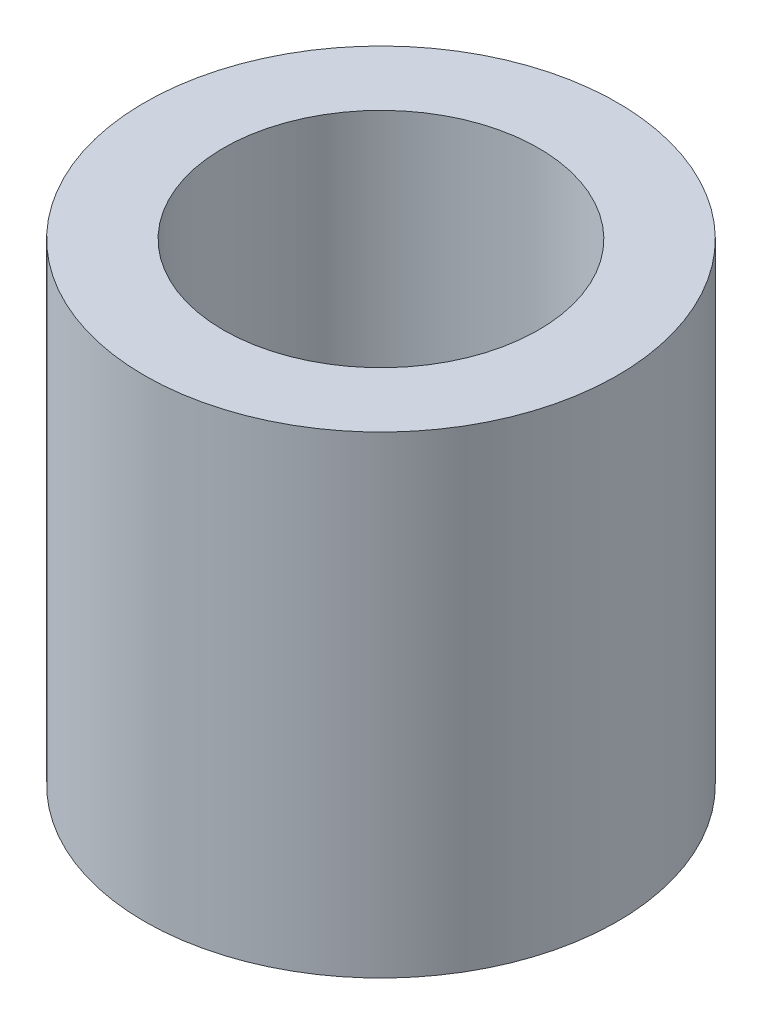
from build123d import *

# Parameters (mm, degrees)
SKETCH1_R           = 1.5
SKETCH1_R_2         = 1
BOSS_EXTRUDE1_DEPTH = 3


with BuildPart() as part:
    # Sketch1 → Boss-Extrude1 (new body)
    with BuildSketch(Plane(origin=(0, 0, 0), x_dir=(1, 0, 0), z_dir=(0, 1, 0))):
        with Locations(Location((0, 0, 0), (0, 0, 270))):
            Circle(SKETCH1_R)
        with Locations(Location((0, 0, 0), (0, 0, 270))):
            Circle(SKETCH1_R_2, mode=Mode.SUBTRACT)
    extrude(amount=BOSS_EXTRUDE1_DEPTH)


solid = part.part
